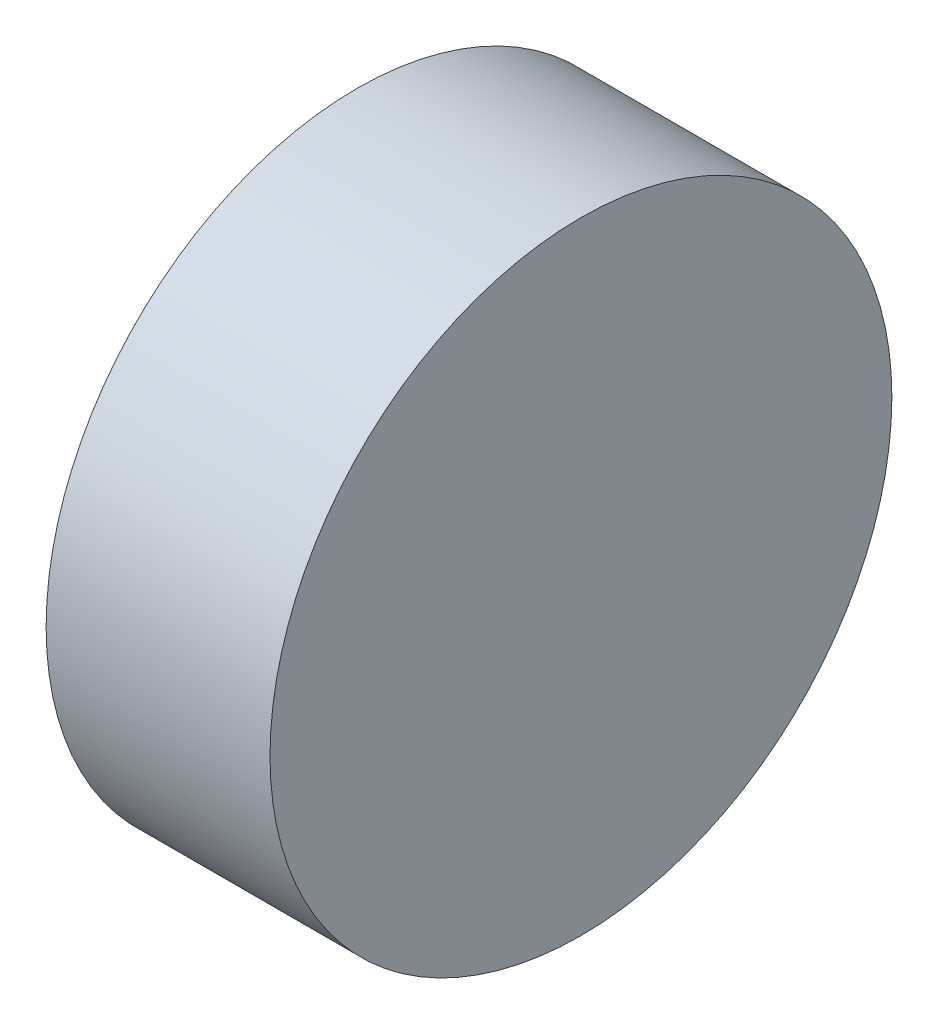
ISO-10303-21;
HEADER;
FILE_DESCRIPTION(('STEP AP214'),'2;1');
FILE_NAME('part.step','',(''),(''),'','','');
FILE_SCHEMA(('AUTOMOTIVE_DESIGN { 1 0 10303 214 1 1 1 1 }'));
ENDSEC;
DATA;
#1=APPLICATION_CONTEXT('core data for automotive mechanical design processes');
#2=APPLICATION_PROTOCOL_DEFINITION('international standard','automotive_design',2000,#1);
#3=PRODUCT_CONTEXT('',#1,'mechanical');
#4=PRODUCT('Part','Part','',(#3));
#5=PRODUCT_RELATED_PRODUCT_CATEGORY('part','',(#4));
#6=PRODUCT_DEFINITION_FORMATION('','',#4);
#7=PRODUCT_DEFINITION_CONTEXT('part definition',#1,'design');
#8=PRODUCT_DEFINITION('design','',#6,#7);
#9=PRODUCT_DEFINITION_SHAPE('','',#8);
#10=(LENGTH_UNIT() NAMED_UNIT(*) SI_UNIT(.MILLI.,.METRE.));
#11=(NAMED_UNIT(*) PLANE_ANGLE_UNIT() SI_UNIT($,.RADIAN.));
#12=(NAMED_UNIT(*) SI_UNIT($,.STERADIAN.) SOLID_ANGLE_UNIT());
#13=UNCERTAINTY_MEASURE_WITH_UNIT(LENGTH_MEASURE(1.E-05),#10,'distance_accuracy_value','');
#14=(GEOMETRIC_REPRESENTATION_CONTEXT(3) GLOBAL_UNCERTAINTY_ASSIGNED_CONTEXT((#13)) GLOBAL_UNIT_ASSIGNED_CONTEXT((#10,
#11,#12)) REPRESENTATION_CONTEXT('',''));
#15=CARTESIAN_POINT('',(0.,0.,0.));
#16=DIRECTION('',(0.,0.,1.));
#17=DIRECTION('',(1.,0.,0.));
#18=AXIS2_PLACEMENT_3D('',#15,#16,#17);
#19=CARTESIAN_POINT('',(27.,37.5,0.));
#20=DIRECTION('',(-1.,0.,0.));
#21=DIRECTION('',(0.,0.,1.));
#22=AXIS2_PLACEMENT_3D('',#19,#20,#21);
#23=PLANE('',#22);
#24=CARTESIAN_POINT('',(27.,0.,0.));
#25=DIRECTION('',(-1.,0.,0.));
#26=DIRECTION('',(0.,0.,1.));
#27=AXIS2_PLACEMENT_3D('',#24,#25,#26);
#28=CIRCLE('',#27,37.5);
#29=CARTESIAN_POINT('',(27.,0.,37.5));
#30=VERTEX_POINT('',#29);
#31=EDGE_CURVE('E10',#30,#30,#28,.T.);
#32=ORIENTED_EDGE('',*,*,#31,.F.);
#33=EDGE_LOOP('',(#32));
#34=FACE_BOUND('',#33,.T.);
#35=ADVANCED_FACE('F28',(#34),#23,.F.);
#36=CARTESIAN_POINT('',(0.,0.,0.));
#37=DIRECTION('',(-1.,0.,0.));
#38=DIRECTION('',(0.,0.,1.));
#39=AXIS2_PLACEMENT_3D('',#36,#37,#38);
#40=CYLINDRICAL_SURFACE('',#39,37.5);
#41=CARTESIAN_POINT('',(0.,0.,0.));
#42=DIRECTION('',(-1.,0.,0.));
#43=DIRECTION('',(0.,0.,1.));
#44=AXIS2_PLACEMENT_3D('',#41,#42,#43);
#45=CIRCLE('',#44,37.5);
#46=CARTESIAN_POINT('',(0.,0.,37.5));
#47=VERTEX_POINT('',#46);
#48=EDGE_CURVE('E34',#47,#47,#45,.T.);
#49=ORIENTED_EDGE('',*,*,#48,.F.);
#50=EDGE_LOOP('',(#49));
#51=FACE_BOUND('',#50,.T.);
#52=ORIENTED_EDGE('',*,*,#31,.T.);
#53=EDGE_LOOP('',(#52));
#54=FACE_BOUND('',#53,.T.);
#55=ADVANCED_FACE('F42',(#51,#54),#40,.T.);
#56=CARTESIAN_POINT('',(0.,0.,0.));
#57=DIRECTION('',(1.,0.,0.));
#58=DIRECTION('',(0.,0.,-1.));
#59=AXIS2_PLACEMENT_3D('',#56,#57,#58);
#60=PLANE('',#59);
#61=ORIENTED_EDGE('',*,*,#48,.T.);
#62=EDGE_LOOP('',(#61));
#63=FACE_BOUND('',#62,.T.);
#64=ADVANCED_FACE('F40',(#63),#60,.F.);
#65=CLOSED_SHELL('',(#35,#55,#64));
#66=MANIFOLD_SOLID_BREP('B2',#65);
#67=ADVANCED_BREP_SHAPE_REPRESENTATION('',(#18,#66),#14);
#68=SHAPE_DEFINITION_REPRESENTATION(#9,#67);
ENDSEC;
END-ISO-10303-21;
